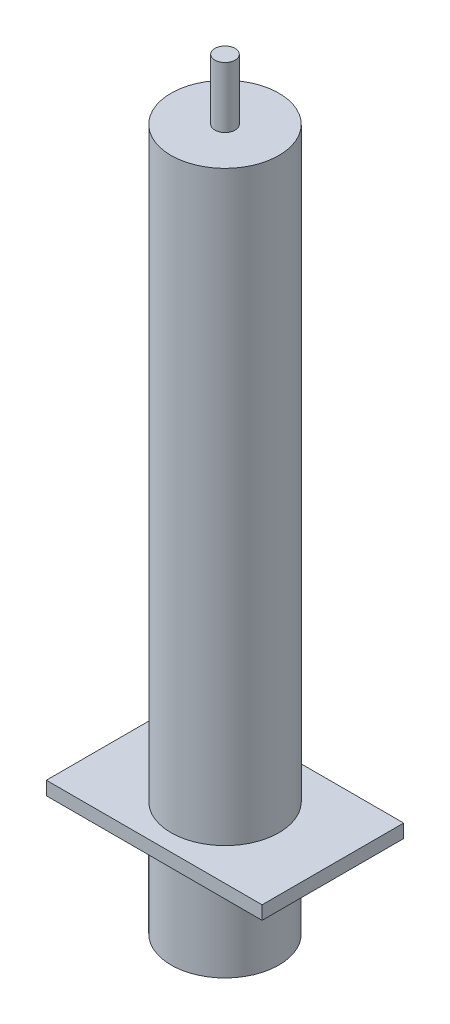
from build123d import *

# Parameters (mm, degrees)
SKETCH_1_R      = 8
EXTRUDE_1_DEPTH = 75
SKETCH_2_R      = 1.6
EXTRUDE_2_DEPTH = 9
SKETCH_3_W      = 32
SKETCH_3_H      = 21
EXTRUDE_3_DEPTH = 2
EXTRUDE_START   = 15
SKETCH_4_R      = 8
EXTRUDE_4_DEPTH = 15
SKETCH_5_R      = 8
EXTRUDE_5_DEPTH = 12
SKETCH_6_R      = 1.5
EXTRUDE_6_DEPTH = 9


with BuildPart() as part:
    # Sketch 1 → Extrude 1 (new body)
    with BuildSketch(Plane(origin=(0, 0, 0), x_dir=(1, 0, 0), z_dir=(0, 1, 0))):
        with Locations(Location((0, 0, 0), (0, 0, 270))):
            Circle(SKETCH_1_R)
    extrude(amount=EXTRUDE_1_DEPTH)

    # Sketch 2 → Extrude 2 (add)
    with BuildSketch(Plane(origin=(0, 75, 0), x_dir=(1, 0, 0), z_dir=(0, 1, 0))):
        with Locations(Location((0, 0, 0), (0, 0, 270))):
            Circle(SKETCH_2_R)
    extrude(amount=EXTRUDE_2_DEPTH)

    # Sketch 3 → Extrude 3 (add)
    with BuildSketch(Plane.XZ):
        Rectangle(SKETCH_3_W, SKETCH_3_H)
    extrude(amount=EXTRUDE_3_DEPTH)

    # Sketch 4 → Extrude 4 (add)
    with BuildSketch(Plane.XZ.offset(2).offset(EXTRUDE_START)):
        with Locations(Location((0, 0, 0), (0, 0, 90))):
            Circle(SKETCH_4_R)
    extrude(amount=-EXTRUDE_4_DEPTH)

    # Sketch 5 → Extrude 5 (add)
    with BuildSketch(Plane(origin=(0, 75, 0), x_dir=(1, 0, 0), z_dir=(0, 1, 0))):
        with Locations(Location((0, 0, 0), (0, 0, 270))):
            Circle(SKETCH_5_R)
    extrude(amount=EXTRUDE_5_DEPTH)

    # Sketch 6 → Extrude 6 (add)
    with BuildSketch(Plane(origin=(0, 87, 0), x_dir=(1, 0, 0), z_dir=(0, 1, 0))):
        with Locations(Location((0, 0, 0), (0, 0, 270))):
            Circle(SKETCH_6_R)
    extrude(amount=EXTRUDE_6_DEPTH)


solid = part.part
